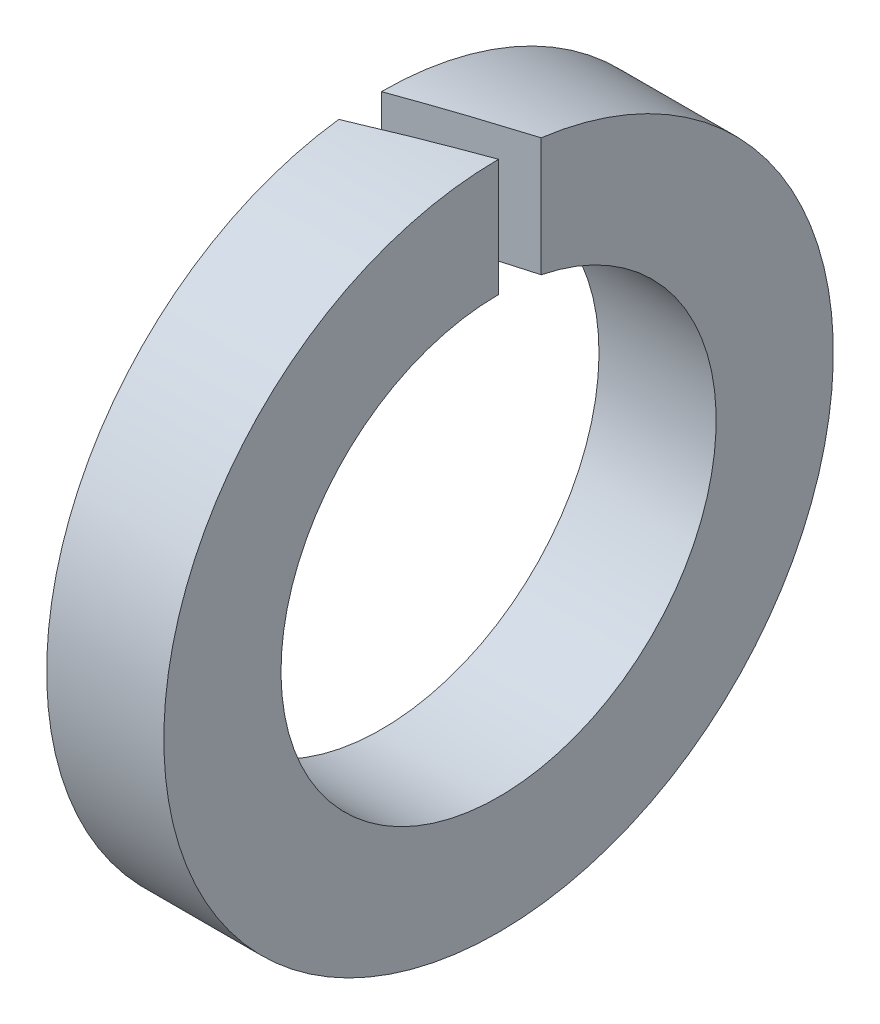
from build123d import *

# Parameters (mm, degrees)
ESQUISSE1_W             = 3.5
ESQUISSE1_H             = 3.5
ENL_V_MAT_EXTRU_1_DEPTH = 15.568802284


with BuildPart() as part:
    # Esquisse1 → Base-R_volution (revolve)
    with BuildSketch(Plane(origin=(0, 0, 0), x_dir=(1, 0, 0), z_dir=(0, 1, 0)), mode=Mode.PRIVATE) as base_r_volution_sk:
        with Locations((1.75, 8.25)):
            Rectangle(ESQUISSE1_W, ESQUISSE1_H)
    revolve(base_r_volution_sk.sketch.rotate(Axis((0, 0, 0), (1, 0, 0)), 180), axis=Axis((0, 0, 0), (1, 0, 0)))

    # Esquisse2 → Enl_v. mat.-Extru.1 (cut, through all)
    with BuildSketch(Plane(origin=(0, 0, 0), x_dir=(1, 0, 0), z_dir=(0, 1, 0))):
        Polygon((0, 0), (3.5, 1.27389582), (3.5, 0), (0, -1.27389582), align=None)
    extrude(amount=ENL_V_MAT_EXTRU_1_DEPTH, mode=Mode.SUBTRACT)


solid = part.part
